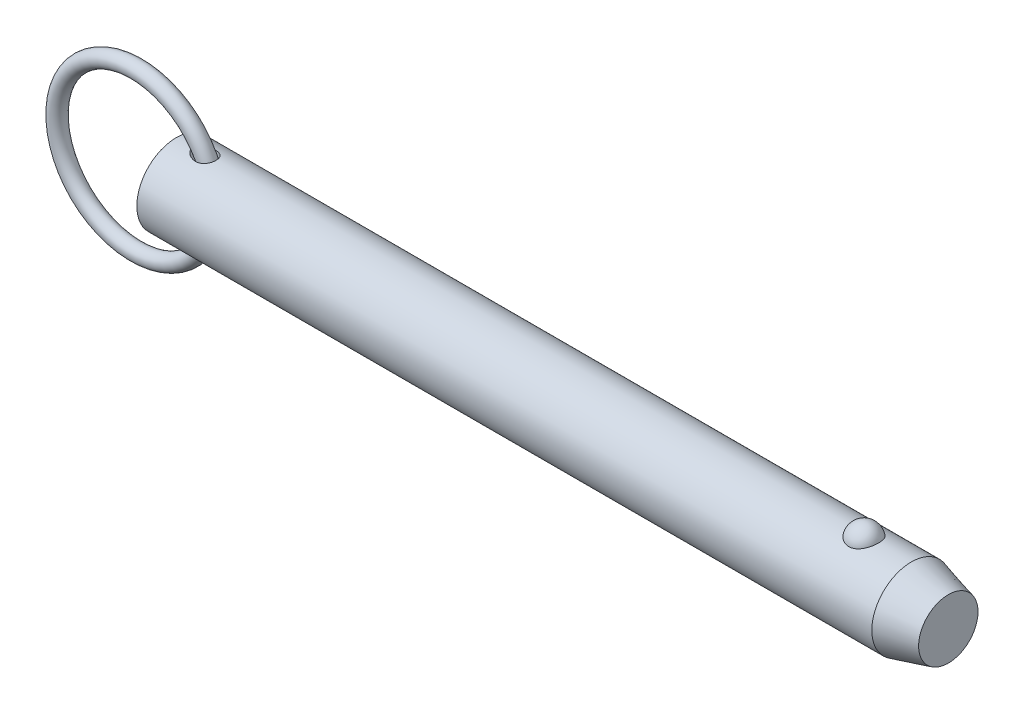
ISO-10303-21;
HEADER;
FILE_DESCRIPTION(('STEP AP214'),'2;1');
FILE_NAME('part.step','',(''),(''),'','','');
FILE_SCHEMA(('AUTOMOTIVE_DESIGN { 1 0 10303 214 1 1 1 1 }'));
ENDSEC;
DATA;
#1=APPLICATION_CONTEXT('core data for automotive mechanical design processes');
#2=APPLICATION_PROTOCOL_DEFINITION('international standard','automotive_design',2000,#1);
#3=PRODUCT_CONTEXT('',#1,'mechanical');
#4=PRODUCT('Part','Part','',(#3));
#5=PRODUCT_RELATED_PRODUCT_CATEGORY('part','',(#4));
#6=PRODUCT_DEFINITION_FORMATION('','',#4);
#7=PRODUCT_DEFINITION_CONTEXT('part definition',#1,'design');
#8=PRODUCT_DEFINITION('design','',#6,#7);
#9=PRODUCT_DEFINITION_SHAPE('','',#8);
#10=(LENGTH_UNIT() NAMED_UNIT(*) SI_UNIT(.MILLI.,.METRE.));
#11=(NAMED_UNIT(*) PLANE_ANGLE_UNIT() SI_UNIT($,.RADIAN.));
#12=(NAMED_UNIT(*) SI_UNIT($,.STERADIAN.) SOLID_ANGLE_UNIT());
#13=UNCERTAINTY_MEASURE_WITH_UNIT(LENGTH_MEASURE(1.E-05),#10,'distance_accuracy_value','');
#14=(GEOMETRIC_REPRESENTATION_CONTEXT(3) GLOBAL_UNCERTAINTY_ASSIGNED_CONTEXT((#13)) GLOBAL_UNIT_ASSIGNED_CONTEXT((#10,
#11,#12)) REPRESENTATION_CONTEXT('',''));
#15=CARTESIAN_POINT('',(0.,0.,0.));
#16=DIRECTION('',(0.,0.,1.));
#17=DIRECTION('',(1.,0.,0.));
#18=AXIS2_PLACEMENT_3D('',#15,#16,#17);
#19=CARTESIAN_POINT('',(-9.66825126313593,0.,0.));
#20=DIRECTION('',(0.,0.,1.));
#21=DIRECTION('',(1.,0.,0.));
#22=AXIS2_PLACEMENT_3D('',#19,#20,#21);
#23=TOROIDAL_SURFACE('',#22,19.05,1.905);
#24=CARTESIAN_POINT('',(11.2867487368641,0.,0.));
#25=VERTEX_POINT('',#24);
#26=VERTEX_LOOP('',#25);
#27=FACE_BOUND('',#26,.T.);
#28=ADVANCED_FACE('P0_F12',(#27),#23,.T.);
#29=CLOSED_SHELL('',(#28));
#30=MANIFOLD_SOLID_BREP('P0_B1',#29);
#31=CARTESIAN_POINT('',(0.,0.,0.));
#32=DIRECTION('',(1.,0.,0.));
#33=DIRECTION('',(0.,0.,-1.));
#34=AXIS2_PLACEMENT_3D('',#31,#32,#33);
#35=CYLINDRICAL_SURFACE('',#34,9.525);
#36=CARTESIAN_POINT('',(4.5669340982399,9.4314194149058,-1.33189820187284));
#37=CARTESIAN_POINT('',(4.70260475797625,9.41020313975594,-1.48215931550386));
#38=CARTESIAN_POINT('',(4.85555680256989,9.38755003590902,-1.61683982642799));
#39=CARTESIAN_POINT('',(5.10171959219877,9.35450554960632,-1.79512943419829));
#40=CARTESIAN_POINT('',(5.18674514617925,9.34362629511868,-1.85068909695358));
#41=CARTESIAN_POINT('',(5.3615438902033,9.32258514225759,-1.95392002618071));
#42=CARTESIAN_POINT('',(5.45131542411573,9.31242299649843,-2.00159402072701));
#43=CARTESIAN_POINT('',(5.70070211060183,9.28632120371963,-2.12033289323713));
#44=CARTESIAN_POINT('',(5.86420408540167,9.2714693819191,-2.18362944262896));
#45=CARTESIAN_POINT('',(6.19893345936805,9.24694163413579,-2.28525783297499));
#46=CARTESIAN_POINT('',(6.37015384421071,9.23726110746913,-2.32361187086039));
#47=CARTESIAN_POINT('',(6.73531776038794,9.22400982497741,-2.37575048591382));
#48=CARTESIAN_POINT('',(6.92975826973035,9.22118808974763,-2.38652934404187));
#49=CARTESIAN_POINT('',(7.21995443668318,9.22416297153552,-2.37494980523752));
#50=CARTESIAN_POINT('',(7.31643847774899,9.22635560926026,-2.366466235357));
#51=CARTESIAN_POINT('',(7.50796421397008,9.2331428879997,-2.33985028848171));
#52=CARTESIAN_POINT('',(7.6030065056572,9.23773650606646,-2.32172202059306));
#53=CARTESIAN_POINT('',(7.83273114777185,9.25183311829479,-2.26504721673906));
#54=CARTESIAN_POINT('',(7.96603028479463,9.26261470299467,-2.2209856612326));
#55=CARTESIAN_POINT('',(8.22310899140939,9.28816519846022,-2.11157306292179));
#56=CARTESIAN_POINT('',(8.34689477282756,9.30293147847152,-2.04623606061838));
#57=CARTESIAN_POINT('',(8.58136049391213,9.3349416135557,-1.89485344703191));
#58=CARTESIAN_POINT('',(8.69199721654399,9.35219324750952,-1.80874222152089));
#59=CARTESIAN_POINT('',(8.89592093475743,9.38707016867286,-1.6179918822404));
#60=CARTESIAN_POINT('',(8.98920771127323,9.40469546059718,-1.51335253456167));
#61=CARTESIAN_POINT('',(9.15057731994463,9.43713590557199,-1.29519427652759));
#62=CARTESIAN_POINT('',(9.21980158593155,9.45205440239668,-1.18253282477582));
#63=CARTESIAN_POINT('',(9.33826736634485,9.47856708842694,-0.946802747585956));
#64=CARTESIAN_POINT('',(9.38751161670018,9.49016173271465,-0.823735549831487));
#65=CARTESIAN_POINT('',(9.46423850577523,9.50859378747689,-0.572614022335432));
#66=CARTESIAN_POINT('',(9.49202393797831,9.5154972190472,-0.444656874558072));
#67=CARTESIAN_POINT('',(9.52636926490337,9.5240690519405,-0.18575268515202));
#68=CARTESIAN_POINT('',(9.53292923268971,9.52573747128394,-0.0548056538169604));
#69=CARTESIAN_POINT('',(9.52467276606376,9.52365852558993,0.206503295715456));
#70=CARTESIAN_POINT('',(9.50983454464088,9.51990564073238,0.33686448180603));
#71=CARTESIAN_POINT('',(9.45907362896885,9.50737852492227,0.593166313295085));
#72=CARTESIAN_POINT('',(9.42315106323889,9.49860432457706,0.719106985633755));
#73=CARTESIAN_POINT('',(9.33106648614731,9.4769892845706,0.962959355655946));
#74=CARTESIAN_POINT('',(9.27490839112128,9.46414923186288,1.08087260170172));
#75=CARTESIAN_POINT('',(9.14375803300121,9.43581000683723,1.30534632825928));
#76=CARTESIAN_POINT('',(9.06876720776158,9.42031103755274,1.41190767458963));
#77=CARTESIAN_POINT('',(8.90203187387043,9.38836719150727,1.61069439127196));
#78=CARTESIAN_POINT('',(8.81029913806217,9.37192298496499,1.70292975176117));
#79=CARTESIAN_POINT('',(8.61268775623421,9.33985045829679,1.87086859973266));
#80=CARTESIAN_POINT('',(8.50680947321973,9.3242221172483,1.94657251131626));
#81=CARTESIAN_POINT('',(8.28220546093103,9.29513431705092,2.08109032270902));
#82=CARTESIAN_POINT('',(8.16329919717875,9.28171415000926,2.13961034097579));
#83=CARTESIAN_POINT('',(7.91756052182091,9.25859072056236,2.23755716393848));
#84=CARTESIAN_POINT('',(7.79072606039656,9.24888842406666,2.27697900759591));
#85=CARTESIAN_POINT('',(7.52377913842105,9.23338749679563,2.33907806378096));
#86=CARTESIAN_POINT('',(7.38334767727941,9.22789571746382,2.36044900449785));
#87=CARTESIAN_POINT('',(7.10081394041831,9.22210229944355,2.3829751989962));
#88=CARTESIAN_POINT('',(6.95871103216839,9.22180269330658,2.38412253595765));
#89=CARTESIAN_POINT('',(6.65642691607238,9.22632724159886,2.36656230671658));
#90=CARTESIAN_POINT('',(6.49641694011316,9.23185415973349,2.3451317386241));
#91=CARTESIAN_POINT('',(6.18115433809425,9.24811737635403,2.28014143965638));
#92=CARTESIAN_POINT('',(6.02590710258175,9.25885936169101,2.23655754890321));
#93=CARTESIAN_POINT('',(5.69904720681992,9.28624254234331,2.12025087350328));
#94=CARTESIAN_POINT('',(5.52873601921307,9.30354853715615,2.04400672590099));
#95=CARTESIAN_POINT('',(5.20289495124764,9.34106989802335,1.86504730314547));
#96=CARTESIAN_POINT('',(5.04735968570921,9.36128419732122,1.76234172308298));
#97=CARTESIAN_POINT('',(4.7928712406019,9.39697639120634,1.55895334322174));
#98=CARTESIAN_POINT('',(4.68938704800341,9.41240250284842,1.46392900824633));
#99=CARTESIAN_POINT('',(4.4984714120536,9.44202586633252,1.25875918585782));
#100=CARTESIAN_POINT('',(4.41101129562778,9.45622528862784,1.1486413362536));
#101=CARTESIAN_POINT('',(4.27502257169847,9.47888210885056,0.940600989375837));
#102=CARTESIAN_POINT('',(4.22216329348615,9.48791121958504,0.84558680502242));
#103=CARTESIAN_POINT('',(4.1324147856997,9.50344321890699,0.648051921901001));
#104=CARTESIAN_POINT('',(4.0955118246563,9.50994827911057,0.545537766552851));
#105=CARTESIAN_POINT('',(4.04043124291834,9.51971586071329,0.334452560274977));
#106=CARTESIAN_POINT('',(4.02240728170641,9.52295176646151,0.22583927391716));
#107=CARTESIAN_POINT('',(4.00750873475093,9.52562364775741,0.00713006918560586));
#108=CARTESIAN_POINT('',(4.01062334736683,9.52506156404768,-0.102965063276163));
#109=CARTESIAN_POINT('',(4.03592967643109,9.52053221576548,-0.306944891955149));
#110=CARTESIAN_POINT('',(4.05571676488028,9.51699426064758,-0.401151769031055));
#111=CARTESIAN_POINT('',(4.10967975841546,9.5074546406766,-0.585176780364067));
#112=CARTESIAN_POINT('',(4.1438599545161,9.50145224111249,-0.674993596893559));
#113=CARTESIAN_POINT('',(4.23261356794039,9.48611703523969,-0.866116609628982));
#114=CARTESIAN_POINT('',(4.28990016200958,9.47635800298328,-0.966121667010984));
#115=CARTESIAN_POINT('',(4.41856577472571,9.45502867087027,-1.15640011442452));
#116=CARTESIAN_POINT('',(4.48996918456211,9.44345524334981,-1.24665623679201));
#117=CARTESIAN_POINT('',(4.5669340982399,9.4314194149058,-1.33189820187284));
#118=B_SPLINE_CURVE_WITH_KNOTS('',3,(#36,#37,#38,#39,#40,#41,#42,#43,#44,#45,#46,#47,#48,#49,
#50,#51,#52,#53,#54,#55,#56,#57,#58,#59,#60,#61,#62,#63,#64,#65,#66,#67,#68,#69,#70,#71,#72,#73,
#74,#75,#76,#77,#78,#79,#80,#81,#82,#83,#84,#85,#86,#87,#88,#89,#90,#91,#92,#93,#94,#95,#96,#97,
#98,#99,#100,#101,#102,#103,#104,#105,#106,#107,#108,#109,#110,#111,#112,#113,#114,#115,#116,
#117),.UNSPECIFIED.,.T.,.F.,(4,2,2,2,2,2,2,2,2,2,2,2,2,2,2,2,2,2,2,2,2,2,2,2,2,2,2,2,2,2,2,2,2,
2,2,2,2,2,2,2,4),(0.,0.609951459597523,0.916123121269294,1.22218863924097,1.74791337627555,
2.27316961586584,2.85362722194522,3.14383229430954,3.43391382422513,3.85437497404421,
4.27455920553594,4.69608835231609,5.11762282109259,5.5149005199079,5.91212379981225,
6.30363414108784,6.69514313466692,7.08705103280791,7.47895654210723,7.87078624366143,
8.26258603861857,8.65411137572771,9.04562666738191,9.44349251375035,9.84146165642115,
10.2662286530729,10.6911619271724,11.1739180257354,11.6572017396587,12.2170157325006,
12.776624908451,13.1992556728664,13.6211226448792,13.9471990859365,14.2729943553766,
14.6014211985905,14.9296802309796,15.2173810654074,15.505167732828,15.8505863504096,
16.1966070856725),.UNSPECIFIED.);
#119=CARTESIAN_POINT('',(4.5669340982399,9.4314194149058,-1.33189820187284));
#120=VERTEX_POINT('',#119);
#121=EDGE_CURVE('P1_E40',#120,#120,#118,.T.);
#122=ORIENTED_EDGE('',*,*,#121,.T.);
#123=EDGE_LOOP('',(#122));
#124=FACE_BOUND('',#123,.T.);
#125=CARTESIAN_POINT('',(176.843054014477,0.,0.));
#126=DIRECTION('',(1.,0.,0.));
#127=DIRECTION('',(0.,0.,-1.));
#128=AXIS2_PLACEMENT_3D('',#125,#126,#127);
#129=CIRCLE('',#128,9.525);
#130=CARTESIAN_POINT('',(176.843054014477,0.,-9.525));
#131=VERTEX_POINT('',#130);
#132=EDGE_CURVE('P1_E25',#131,#131,#129,.T.);
#133=ORIENTED_EDGE('',*,*,#132,.F.);
#134=EDGE_LOOP('',(#133));
#135=FACE_BOUND('',#134,.T.);
#136=CARTESIAN_POINT('',(0.,0.,0.));
#137=DIRECTION('',(1.,0.,0.));
#138=DIRECTION('',(0.,0.,-1.));
#139=AXIS2_PLACEMENT_3D('',#136,#137,#138);
#140=CIRCLE('',#139,9.525);
#141=CARTESIAN_POINT('',(0.,0.,-9.525));
#142=VERTEX_POINT('',#141);
#143=EDGE_CURVE('P1_E9',#142,#142,#140,.T.);
#144=ORIENTED_EDGE('',*,*,#143,.T.);
#145=EDGE_LOOP('',(#144));
#146=FACE_BOUND('',#145,.T.);
#147=CARTESIAN_POINT('',(165.445757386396,8.80405803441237,3.63513233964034));
#148=CARTESIAN_POINT('',(165.351676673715,8.80405953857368,3.63513053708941));
#149=CARTESIAN_POINT('',(165.257561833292,8.80561325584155,3.63137461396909));
#150=CARTESIAN_POINT('',(165.070012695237,8.81177748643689,3.61638665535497));
#151=CARTESIAN_POINT('',(164.976578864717,8.81638992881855,3.60514990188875));
#152=CARTESIAN_POINT('',(164.697945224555,8.83467114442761,3.56024627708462));
#153=CARTESIAN_POINT('',(164.514691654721,8.85278327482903,3.5153862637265));
#154=CARTESIAN_POINT('',(164.159509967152,8.89871214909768,3.39742145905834));
#155=CARTESIAN_POINT('',(163.987553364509,8.92650327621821,3.32439116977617));
#156=CARTESIAN_POINT('',(163.658707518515,8.9887481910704,3.15220244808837));
#157=CARTESIAN_POINT('',(163.501811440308,9.02319893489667,3.05305594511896));
#158=CARTESIAN_POINT('',(163.202214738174,9.09629186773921,2.82797815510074));
#159=CARTESIAN_POINT('',(163.060060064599,9.13502685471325,2.70135138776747));
#160=CARTESIAN_POINT('',(162.798299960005,9.21186572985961,2.42641932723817));
#161=CARTESIAN_POINT('',(162.678701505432,9.24996941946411,2.2781073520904));
#162=CARTESIAN_POINT('',(162.459645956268,9.32341082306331,1.95652290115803));
#163=CARTESIAN_POINT('',(162.361317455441,9.35855090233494,1.78243511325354));
#164=CARTESIAN_POINT('',(162.193819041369,9.42045142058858,1.41937246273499));
#165=CARTESIAN_POINT('',(162.124651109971,9.44721128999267,1.23039658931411));
#166=CARTESIAN_POINT('',(162.016199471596,9.48990641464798,0.840370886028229));
#167=CARTESIAN_POINT('',(161.977288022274,9.50570658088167,0.639202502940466));
#168=CARTESIAN_POINT('',(161.931555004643,9.52433146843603,0.232664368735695));
#169=CARTESIAN_POINT('',(161.924732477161,9.52715657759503,0.0272947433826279));
#170=CARTESIAN_POINT('',(161.943255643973,9.51956918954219,-0.380478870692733));
#171=CARTESIAN_POINT('',(161.968405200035,9.50923740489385,-0.582893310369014));
#172=CARTESIAN_POINT('',(162.05002537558,9.47651897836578,-0.980293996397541));
#173=CARTESIAN_POINT('',(162.106496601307,9.45413210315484,-1.17528009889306));
#174=CARTESIAN_POINT('',(162.249719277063,9.39954044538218,-1.55263697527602));
#175=CARTESIAN_POINT('',(162.336512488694,9.36732213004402,-1.73498993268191));
#176=CARTESIAN_POINT('',(162.538610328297,9.29640700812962,-2.08177763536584));
#177=CARTESIAN_POINT('',(162.653917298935,9.25770966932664,-2.24621090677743));
#178=CARTESIAN_POINT('',(162.911264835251,9.17775604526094,-2.5533833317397));
#179=CARTESIAN_POINT('',(163.053434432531,9.136488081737,-2.696011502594));
#180=CARTESIAN_POINT('',(163.36089985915,9.05620497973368,-2.95451229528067));
#181=CARTESIAN_POINT('',(163.526193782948,9.01718965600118,-3.07038711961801));
#182=CARTESIAN_POINT('',(163.872052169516,8.94680019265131,-3.26976836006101));
#183=CARTESIAN_POINT('',(164.052227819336,8.91528408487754,-3.35389750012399));
#184=CARTESIAN_POINT('',(164.425651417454,8.86272514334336,-3.49043503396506));
#185=CARTESIAN_POINT('',(164.618894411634,8.84167836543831,-3.54285537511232));
#186=CARTESIAN_POINT('',(165.002503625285,8.81348056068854,-3.61241306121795));
#187=CARTESIAN_POINT('',(165.192525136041,8.80568348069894,-3.6311933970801));
#188=CARTESIAN_POINT('',(165.573190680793,8.80289410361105,-3.63795342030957));
#189=CARTESIAN_POINT('',(165.763834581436,8.80789922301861,-3.62593932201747));
#190=CARTESIAN_POINT('',(166.134007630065,8.82974915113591,-3.57238430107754));
#191=CARTESIAN_POINT('',(166.313697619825,8.84621463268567,-3.53178890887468));
#192=CARTESIAN_POINT('',(166.663422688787,8.88875330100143,-3.42331083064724));
#193=CARTESIAN_POINT('',(166.833456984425,8.91482726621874,-3.35542593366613));
#194=CARTESIAN_POINT('',(167.163237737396,8.97448239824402,-3.19248225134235));
#195=CARTESIAN_POINT('',(167.322680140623,9.00821446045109,-3.0968647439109));
#196=CARTESIAN_POINT('',(167.623513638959,9.07935398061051,-2.88162736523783));
#197=CARTESIAN_POINT('',(167.764900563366,9.11676228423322,-2.76200196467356));
#198=CARTESIAN_POINT('',(168.03331931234,9.19347419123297,-2.49516285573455));
#199=CARTESIAN_POINT('',(168.159275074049,9.23277872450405,-2.34686614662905));
#200=CARTESIAN_POINT('',(168.385522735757,9.30737610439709,-2.03093683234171));
#201=CARTESIAN_POINT('',(168.48581004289,9.34266823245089,-1.86330077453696));
#202=CARTESIAN_POINT('',(168.661514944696,9.40674710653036,-1.50744893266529));
#203=CARTESIAN_POINT('',(168.736041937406,9.43529176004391,-1.31874876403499));
#204=CARTESIAN_POINT('',(168.85416505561,9.48144132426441,-0.930631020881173));
#205=CARTESIAN_POINT('',(168.897760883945,9.49904612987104,-0.731213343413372));
#206=CARTESIAN_POINT('',(168.953158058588,9.5215314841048,-0.327147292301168));
#207=CARTESIAN_POINT('',(168.964935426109,9.52640243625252,-0.122495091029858));
#208=CARTESIAN_POINT('',(168.956382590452,9.5228957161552,0.286018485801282));
#209=CARTESIAN_POINT('',(168.93605305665,9.5145183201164,0.489879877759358));
#210=CARTESIAN_POINT('',(168.863884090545,9.48544083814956,0.88999431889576));
#211=CARTESIAN_POINT('',(168.812199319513,9.46480124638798,1.08627971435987));
#212=CARTESIAN_POINT('',(168.678491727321,9.4133389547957,1.46682086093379));
#213=CARTESIAN_POINT('',(168.596466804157,9.38251554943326,1.65107577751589));
#214=CARTESIAN_POINT('',(168.40319292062,9.31365636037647,2.00346348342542));
#215=CARTESIAN_POINT('',(168.291783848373,9.27558138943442,2.17150083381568));
#216=CARTESIAN_POINT('',(168.042294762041,9.19638714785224,2.48563115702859));
#217=CARTESIAN_POINT('',(167.904216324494,9.15526805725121,2.63172542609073));
#218=CARTESIAN_POINT('',(167.604843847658,9.07465393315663,2.89750997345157));
#219=CARTESIAN_POINT('',(167.443610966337,9.03515496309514,3.01726776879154));
#220=CARTESIAN_POINT('',(167.101613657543,8.96227564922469,3.22732920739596));
#221=CARTESIAN_POINT('',(166.920841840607,8.92889763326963,3.31762165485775));
#222=CARTESIAN_POINT('',(166.551445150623,8.8734538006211,3.46314419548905));
#223=CARTESIAN_POINT('',(166.36332371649,8.85102983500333,3.51950082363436));
#224=CARTESIAN_POINT('',(166.07578699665,8.82666967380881,3.57993683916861));
#225=CARTESIAN_POINT('',(165.979133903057,8.82009725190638,3.59606217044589));
#226=CARTESIAN_POINT('',(165.784677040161,8.81020897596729,3.62022512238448));
#227=CARTESIAN_POINT('',(165.68687410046,8.80689090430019,3.62826825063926));
#228=CARTESIAN_POINT('',(165.541224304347,8.80445615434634,3.63416760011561));
#229=CARTESIAN_POINT('',(165.493495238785,8.80405727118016,3.63513325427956));
#230=CARTESIAN_POINT('',(165.445757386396,8.80405803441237,3.63513233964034));
#231=B_SPLINE_CURVE_WITH_KNOTS('',3,(#147,#148,#149,#150,#151,#152,#153,#154,#155,#156,#157,
#158,#159,#160,#161,#162,#163,#164,#165,#166,#167,#168,#169,#170,#171,#172,#173,#174,#175,#176,
#177,#178,#179,#180,#181,#182,#183,#184,#185,#186,#187,#188,#189,#190,#191,#192,#193,#194,#195,
#196,#197,#198,#199,#200,#201,#202,#203,#204,#205,#206,#207,#208,#209,#210,#211,#212,#213,#214,
#215,#216,#217,#218,#219,#220,#221,#222,#223,#224,#225,#226,#227,#228,#229,#230),.UNSPECIFIED.,
.T.,.F.,(4,2,2,2,2,2,2,2,2,2,2,2,2,2,2,2,2,2,2,2,2,2,2,2,2,2,2,2,2,2,2,2,2,2,2,2,2,2,2,2,2,4),
(0.,0.282202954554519,0.564584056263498,1.13017050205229,1.69427128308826,2.25811483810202,
2.83836627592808,3.41879688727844,4.02497117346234,4.63118665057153,5.24474754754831,
5.85829010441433,6.46808687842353,7.07789545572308,7.68854723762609,8.299249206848,
8.91296283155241,9.52662591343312,10.1275338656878,10.7282152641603,11.2986646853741,
11.8689989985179,12.4213015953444,12.973648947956,13.5380053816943,14.1024919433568,
14.695298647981,15.2882113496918,15.8999469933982,16.5116885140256,17.1238909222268,
17.7360805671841,18.3452748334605,18.9545113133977,19.567138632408,20.179729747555,
20.7907316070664,21.4019653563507,21.9915938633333,22.2859053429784,22.5800161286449,
22.7232098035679),.UNSPECIFIED.);
#232=CARTESIAN_POINT('',(165.445757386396,8.80405803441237,3.63513233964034));
#233=VERTEX_POINT('',#232);
#234=EDGE_CURVE('P1_E34',#233,#233,#231,.T.);
#235=ORIENTED_EDGE('',*,*,#234,.T.);
#236=EDGE_LOOP('',(#235));
#237=FACE_BOUND('',#236,.T.);
#238=CARTESIAN_POINT('',(4.5669340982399,-9.4314194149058,-1.33189820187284));
#239=CARTESIAN_POINT('',(4.48932984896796,-9.4435553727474,-1.24594548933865));
#240=CARTESIAN_POINT('',(4.41737309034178,-9.45522193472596,-1.1548795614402));
#241=CARTESIAN_POINT('',(4.28781047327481,-9.47670896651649,-0.962782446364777));
#242=CARTESIAN_POINT('',(4.23019403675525,-9.48653079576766,-0.861758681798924));
#243=CARTESIAN_POINT('',(4.132545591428,-9.5034118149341,-0.649723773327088));
#244=CARTESIAN_POINT('',(4.09271158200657,-9.51043980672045,-0.538615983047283));
#245=CARTESIAN_POINT('',(4.04973167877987,-9.51806966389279,-0.367764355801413));
#246=CARTESIAN_POINT('',(4.03820037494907,-9.52012756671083,-0.310118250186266));
#247=CARTESIAN_POINT('',(4.02100287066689,-9.52320274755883,-0.193935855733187));
#248=CARTESIAN_POINT('',(4.0153356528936,-9.52422020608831,-0.135399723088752));
#249=CARTESIAN_POINT('',(4.0081707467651,-9.52550497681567,0.0247266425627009));
#250=CARTESIAN_POINT('',(4.0127049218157,-9.52468821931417,0.126661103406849));
#251=CARTESIAN_POINT('',(4.03954973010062,-9.51988506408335,0.328012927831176));
#252=CARTESIAN_POINT('',(4.06186450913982,-9.51589792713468,0.427429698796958));
#253=CARTESIAN_POINT('',(4.12088980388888,-9.50548528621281,0.616362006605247));
#254=CARTESIAN_POINT('',(4.15684838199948,-9.49918763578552,0.706123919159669));
#255=CARTESIAN_POINT('',(4.24094647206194,-9.48470618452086,0.87952277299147));
#256=CARTESIAN_POINT('',(4.28909090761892,-9.47652162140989,0.963157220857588));
#257=CARTESIAN_POINT('',(4.42295891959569,-9.45426317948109,1.16513741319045));
#258=CARTESIAN_POINT('',(4.51523752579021,-9.43933320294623,1.27905352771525));
#259=CARTESIAN_POINT('',(4.71682295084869,-9.40825940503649,1.49055892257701));
#260=CARTESIAN_POINT('',(4.82617286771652,-9.39211256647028,1.58810554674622));
#261=CARTESIAN_POINT('',(5.09064226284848,-9.35555264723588,1.79246125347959));
#262=CARTESIAN_POINT('',(5.2499041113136,-9.33524115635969,1.89393122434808));
#263=CARTESIAN_POINT('',(5.58309255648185,-9.29785396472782,2.06968659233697));
#264=CARTESIAN_POINT('',(5.75702897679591,-9.28078045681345,2.14395359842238));
#265=CARTESIAN_POINT('',(6.11646882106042,-9.25213303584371,2.26440412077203));
#266=CARTESIAN_POINT('',(6.30205582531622,-9.2406056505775,2.31035092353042));
#267=CARTESIAN_POINT('',(6.67856093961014,-9.22541807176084,2.37029728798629));
#268=CARTESIAN_POINT('',(6.86947045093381,-9.22174585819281,2.38434566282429));
#269=CARTESIAN_POINT('',(7.21217144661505,-9.22344239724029,2.37775005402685));
#270=CARTESIAN_POINT('',(7.36409439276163,-9.22713860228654,2.36352577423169));
#271=CARTESIAN_POINT('',(7.66346227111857,-9.24048072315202,2.31082299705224));
#272=CARTESIAN_POINT('',(7.81090958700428,-9.25012341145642,2.27235765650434));
#273=CARTESIAN_POINT('',(8.09730316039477,-9.2746609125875,2.17003648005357));
#274=CARTESIAN_POINT('',(8.23619652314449,-9.28958517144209,2.10603803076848));
#275=CARTESIAN_POINT('',(8.49918675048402,-9.32290326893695,1.95324442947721));
#276=CARTESIAN_POINT('',(8.62328895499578,-9.34129584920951,1.86445826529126));
#277=CARTESIAN_POINT('',(8.84006515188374,-9.37706953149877,1.67466761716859));
#278=CARTESIAN_POINT('',(8.93465172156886,-9.39436331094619,1.57582357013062));
#279=CARTESIAN_POINT('',(9.10490234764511,-9.42761680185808,1.36280955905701));
#280=CARTESIAN_POINT('',(9.18057146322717,-9.44357686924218,1.24864370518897));
#281=CARTESIAN_POINT('',(9.30789178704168,-9.47159985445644,1.01379272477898));
#282=CARTESIAN_POINT('',(9.36045544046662,-9.48380365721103,0.893617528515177));
#283=CARTESIAN_POINT('',(9.44498362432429,-9.50388751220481,0.64589020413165));
#284=CARTESIAN_POINT('',(9.47694947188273,-9.51176784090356,0.518338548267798));
#285=CARTESIAN_POINT('',(9.51944262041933,-9.52232073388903,0.260103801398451));
#286=CARTESIAN_POINT('',(9.53006646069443,-9.52501674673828,0.129437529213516));
#287=CARTESIAN_POINT('',(9.52993291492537,-9.52498309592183,-0.131885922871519));
#288=CARTESIAN_POINT('',(9.51917525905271,-9.52225336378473,-0.262543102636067));
#289=CARTESIAN_POINT('',(9.47648788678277,-9.51165418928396,-0.520312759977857));
#290=CARTESIAN_POINT('',(9.44453086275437,-9.50377811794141,-0.647420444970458));
#291=CARTESIAN_POINT('',(9.36015568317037,-9.48373425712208,-0.894290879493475));
#292=CARTESIAN_POINT('',(9.30773827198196,-9.47156662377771,-1.01405389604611));
#293=CARTESIAN_POINT('',(9.18380895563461,-9.44428888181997,-1.24269386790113));
#294=CARTESIAN_POINT('',(9.11232064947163,-9.42918241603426,-1.35158405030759));
#295=CARTESIAN_POINT('',(8.9521268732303,-9.39767706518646,-1.55562459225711));
#296=CARTESIAN_POINT('',(8.86342281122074,-9.3812782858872,-1.65077607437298));
#297=CARTESIAN_POINT('',(8.67104443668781,-9.34891827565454,-1.8251751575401));
#298=CARTESIAN_POINT('',(8.56732858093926,-9.33295841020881,-1.90437711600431));
#299=CARTESIAN_POINT('',(8.3481843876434,-9.30317889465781,-2.0449122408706));
#300=CARTESIAN_POINT('',(8.23275529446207,-9.28935938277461,-2.10624425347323));
#301=CARTESIAN_POINT('',(7.9896124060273,-9.26475003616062,-2.2120340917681));
#302=CARTESIAN_POINT('',(7.86162088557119,-9.25407358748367,-2.25587700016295));
#303=CARTESIAN_POINT('',(7.60027499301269,-9.23720810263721,-2.32397032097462));
#304=CARTESIAN_POINT('',(7.46691858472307,-9.23102078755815,-2.34821321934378));
#305=CARTESIAN_POINT('',(7.18516230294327,-9.22302718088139,-2.37943079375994));
#306=CARTESIAN_POINT('',(7.03654454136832,-9.22169704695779,-2.38452997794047));
#307=CARTESIAN_POINT('',(6.74015049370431,-9.22442327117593,-2.37395141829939));
#308=CARTESIAN_POINT('',(6.5923745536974,-9.22848170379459,-2.35826567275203));
#309=CARTESIAN_POINT('',(6.27762777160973,-9.2422287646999,-2.30385559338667));
#310=CARTESIAN_POINT('',(6.11124715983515,-9.25269504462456,-2.26192683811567));
#311=CARTESIAN_POINT('',(5.78635920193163,-9.27830776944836,-2.15445569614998));
#312=CARTESIAN_POINT('',(5.62786567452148,-9.29346211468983,-2.08887341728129));
#313=CARTESIAN_POINT('',(5.39013065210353,-9.31931237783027,-1.96924953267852));
#314=CARTESIAN_POINT('',(5.30683088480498,-9.32901725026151,-1.92292485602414));
#315=CARTESIAN_POINT('',(5.14455801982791,-9.34899035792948,-1.82334419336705));
#316=CARTESIAN_POINT('',(5.06558607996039,-9.35925874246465,-1.77008636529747));
#317=CARTESIAN_POINT('',(4.83670950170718,-9.39034445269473,-1.60010986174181));
#318=CARTESIAN_POINT('',(4.69422471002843,-9.41151337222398,-1.47288240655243));
#319=CARTESIAN_POINT('',(4.5669340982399,-9.4314194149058,-1.33189820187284));
#320=B_SPLINE_CURVE_WITH_KNOTS('',3,(#238,#239,#240,#241,#242,#243,#244,#245,#246,#247,#248,
#249,#250,#251,#252,#253,#254,#255,#256,#257,#258,#259,#260,#261,#262,#263,#264,#265,#266,#267,
#268,#269,#270,#271,#272,#273,#274,#275,#276,#277,#278,#279,#280,#281,#282,#283,#284,#285,#286,
#287,#288,#289,#290,#291,#292,#293,#294,#295,#296,#297,#298,#299,#300,#301,#302,#303,#304,#305,
#306,#307,#308,#309,#310,#311,#312,#313,#314,#315,#316,#317,#318,#319),.UNSPECIFIED.,.T.,.F.,(4,
2,2,2,2,2,2,2,2,2,2,2,2,2,2,2,2,2,2,2,2,2,2,2,2,2,2,2,2,2,2,2,2,2,2,2,2,2,2,2,4),(0.,
0.348900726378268,0.697543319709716,1.0499765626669,1.22617690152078,1.40234666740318,
1.70666745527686,2.01105922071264,2.30066493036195,2.59038784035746,3.03001384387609,
3.47076822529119,4.03766594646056,4.60494622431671,5.17690598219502,5.74798989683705,
6.20400848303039,6.65977977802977,7.11813321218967,7.57632066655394,7.98791759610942,
8.39940433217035,8.79273459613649,9.18603970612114,9.57756168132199,9.96908859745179,
10.3611208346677,10.7531388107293,11.1446739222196,11.536177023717,11.9287850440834,
12.3214184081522,12.7268448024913,13.1324265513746,13.5768390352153,14.0214226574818,
14.5351685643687,15.0497849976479,15.3368801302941,15.6240516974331,16.1963372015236),.UNSPECIFIED.);
#321=CARTESIAN_POINT('',(4.5669340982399,-9.4314194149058,-1.33189820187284));
#322=VERTEX_POINT('',#321);
#323=EDGE_CURVE('P1_E17',#322,#322,#320,.T.);
#324=ORIENTED_EDGE('',*,*,#323,.T.);
#325=EDGE_LOOP('',(#324));
#326=FACE_BOUND('',#325,.T.);
#327=ADVANCED_FACE('P1_F13',(#124,#135,#146,#237,#326),#35,.T.);
#328=CARTESIAN_POINT('',(0.,0.,0.));
#329=DIRECTION('',(-1.,0.,0.));
#330=DIRECTION('',(0.,0.,1.));
#331=AXIS2_PLACEMENT_3D('',#328,#329,#330);
#332=PLANE('',#331);
#333=ORIENTED_EDGE('',*,*,#143,.F.);
#334=EDGE_LOOP('',(#333));
#335=FACE_BOUND('',#334,.T.);
#336=ADVANCED_FACE('P1_F15',(#335),#332,.T.);
#337=CARTESIAN_POINT('',(185.73,0.,0.));
#338=DIRECTION('',(-1.,0.,0.));
#339=DIRECTION('',(0.,0.,1.));
#340=AXIS2_PLACEMENT_3D('',#337,#338,#339);
#341=CONICAL_SURFACE('',#340,7.14375000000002,0.261799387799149);
#342=ORIENTED_EDGE('',*,*,#132,.T.);
#343=EDGE_LOOP('',(#342));
#344=FACE_BOUND('',#343,.T.);
#345=CARTESIAN_POINT('',(185.73,0.,0.));
#346=DIRECTION('',(1.,0.,0.));
#347=DIRECTION('',(0.,0.,-1.));
#348=AXIS2_PLACEMENT_3D('',#345,#346,#347);
#349=CIRCLE('',#348,7.14375000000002);
#350=CARTESIAN_POINT('',(185.73,0.,-7.14375000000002));
#351=VERTEX_POINT('',#350);
#352=EDGE_CURVE('P1_E30',#351,#351,#349,.T.);
#353=ORIENTED_EDGE('',*,*,#352,.F.);
#354=EDGE_LOOP('',(#353));
#355=FACE_BOUND('',#354,.T.);
#356=ADVANCED_FACE('P1_F55',(#344,#355),#341,.T.);
#357=CARTESIAN_POINT('',(185.73,7.14375000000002,0.));
#358=DIRECTION('',(1.,0.,0.));
#359=DIRECTION('',(0.,0.,-1.));
#360=AXIS2_PLACEMENT_3D('',#357,#358,#359);
#361=PLANE('',#360);
#362=ORIENTED_EDGE('',*,*,#352,.T.);
#363=EDGE_LOOP('',(#362));
#364=FACE_BOUND('',#363,.T.);
#365=ADVANCED_FACE('P1_F51',(#364),#361,.T.);
#366=CARTESIAN_POINT('',(165.445757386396,8.5725,0.));
#367=DIRECTION('',(-1.,0.,0.));
#368=DIRECTION('',(0.,1.,0.));
#369=AXIS2_PLACEMENT_3D('',#366,#367,#368);
#370=SPHERICAL_SURFACE('',#369,3.64249999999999);
#371=ORIENTED_EDGE('',*,*,#234,.F.);
#372=EDGE_LOOP('',(#371));
#373=FACE_BOUND('',#372,.T.);
#374=ADVANCED_FACE('P1_F46',(#373),#370,.T.);
#375=CARTESIAN_POINT('',(-9.66825126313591,0.,0.));
#376=DIRECTION('',(0.,0.,1.));
#377=DIRECTION('',(1.,0.,0.));
#378=AXIS2_PLACEMENT_3D('',#375,#376,#377);
#379=TOROIDAL_SURFACE('',#378,19.05,2.38125);
#380=ORIENTED_EDGE('',*,*,#323,.F.);
#381=EDGE_LOOP('',(#380));
#382=FACE_BOUND('',#381,.T.);
#383=ORIENTED_EDGE('',*,*,#121,.F.);
#384=EDGE_LOOP('',(#383));
#385=FACE_BOUND('',#384,.T.);
#386=ADVANCED_FACE('P1_F50',(#382,#385),#379,.F.);
#387=CLOSED_SHELL('',(#327,#336,#356,#365,#374,#386));
#388=MANIFOLD_SOLID_BREP('P1_B1',#387);
#389=ADVANCED_BREP_SHAPE_REPRESENTATION('',(#18,#30,#388),#14);
#390=SHAPE_DEFINITION_REPRESENTATION(#9,#389);
ENDSEC;
END-ISO-10303-21;
